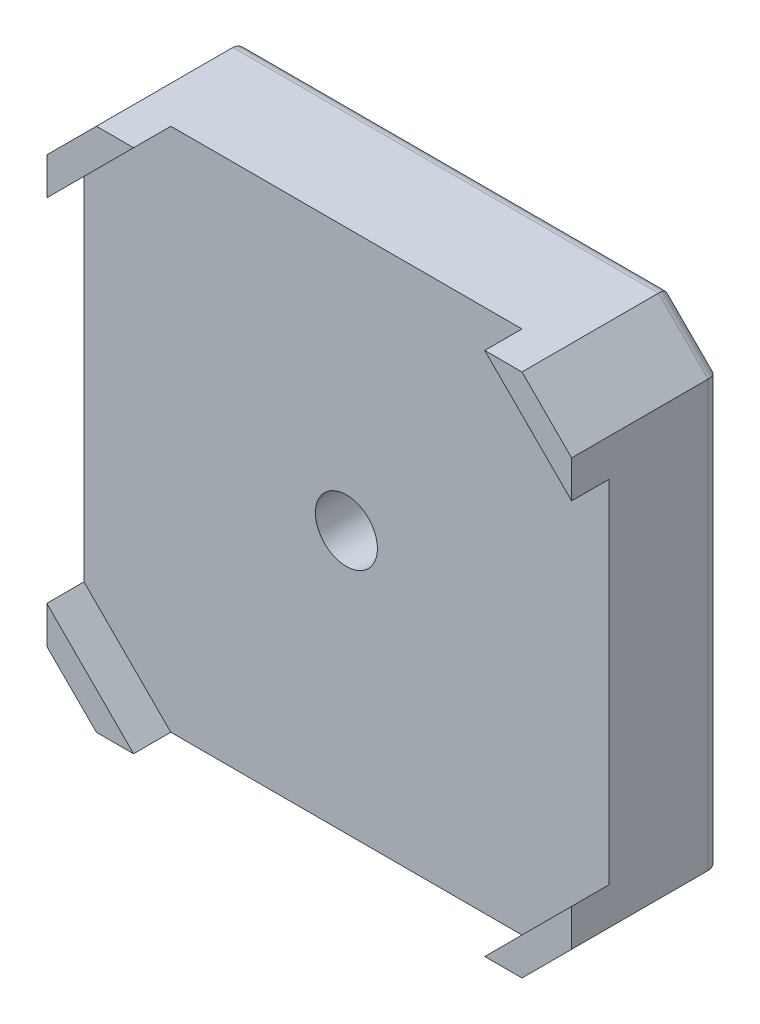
ISO-10303-21;
HEADER;
FILE_DESCRIPTION(('STEP AP214'),'2;1');
FILE_NAME('part.step','',(''),(''),'','','');
FILE_SCHEMA(('AUTOMOTIVE_DESIGN { 1 0 10303 214 1 1 1 1 }'));
ENDSEC;
DATA;
#1=APPLICATION_CONTEXT('core data for automotive mechanical design processes');
#2=APPLICATION_PROTOCOL_DEFINITION('international standard','automotive_design',2000,#1);
#3=PRODUCT_CONTEXT('',#1,'mechanical');
#4=PRODUCT('Part','Part','',(#3));
#5=PRODUCT_RELATED_PRODUCT_CATEGORY('part','',(#4));
#6=PRODUCT_DEFINITION_FORMATION('','',#4);
#7=PRODUCT_DEFINITION_CONTEXT('part definition',#1,'design');
#8=PRODUCT_DEFINITION('design','',#6,#7);
#9=PRODUCT_DEFINITION_SHAPE('','',#8);
#10=(LENGTH_UNIT() NAMED_UNIT(*) SI_UNIT(.MILLI.,.METRE.));
#11=(NAMED_UNIT(*) PLANE_ANGLE_UNIT() SI_UNIT($,.RADIAN.));
#12=(NAMED_UNIT(*) SI_UNIT($,.STERADIAN.) SOLID_ANGLE_UNIT());
#13=UNCERTAINTY_MEASURE_WITH_UNIT(LENGTH_MEASURE(1.E-05),#10,'distance_accuracy_value','');
#14=(GEOMETRIC_REPRESENTATION_CONTEXT(3) GLOBAL_UNCERTAINTY_ASSIGNED_CONTEXT((#13)) GLOBAL_UNIT_ASSIGNED_CONTEXT((#10,
#11,#12)) REPRESENTATION_CONTEXT('',''));
#15=CARTESIAN_POINT('',(0.,0.,0.));
#16=DIRECTION('',(0.,0.,1.));
#17=DIRECTION('',(1.,0.,0.));
#18=AXIS2_PLACEMENT_3D('',#15,#16,#17);
#19=CARTESIAN_POINT('',(0.,0.,12.));
#20=DIRECTION('',(0.,0.,-1.));
#21=DIRECTION('',(-1.,0.,0.));
#22=AXIS2_PLACEMENT_3D('',#19,#20,#21);
#23=PLANE('',#22);
#24=DIRECTION('',(-1.,0.,0.));
#25=VECTOR('',#24,1.);
#26=CARTESIAN_POINT('',(-17.15,21.15,12.));
#27=LINE('',#26,#25);
#28=CARTESIAN_POINT('',(17.15,21.15,12.));
#29=VERTEX_POINT('',#28);
#30=CARTESIAN_POINT('',(14.15,21.15,12.));
#31=VERTEX_POINT('',#30);
#32=EDGE_CURVE('E216',#29,#31,#27,.T.);
#33=ORIENTED_EDGE('',*,*,#32,.T.);
#34=DIRECTION('',(-0.707106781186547,0.707106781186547,0.));
#35=VECTOR('',#34,1.);
#36=CARTESIAN_POINT('',(14.15,21.15,12.));
#37=LINE('',#36,#35);
#38=CARTESIAN_POINT('',(21.15,14.15,12.));
#39=VERTEX_POINT('',#38);
#40=EDGE_CURVE('E201',#39,#31,#37,.T.);
#41=ORIENTED_EDGE('',*,*,#40,.F.);
#42=DIRECTION('',(0.,1.,0.));
#43=VECTOR('',#42,1.);
#44=CARTESIAN_POINT('',(21.15,17.15,12.));
#45=LINE('',#44,#43);
#46=CARTESIAN_POINT('',(21.15,17.15,12.));
#47=VERTEX_POINT('',#46);
#48=EDGE_CURVE('E239',#39,#47,#45,.T.);
#49=ORIENTED_EDGE('',*,*,#48,.T.);
#50=DIRECTION('',(-0.707106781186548,0.707106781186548,0.));
#51=VECTOR('',#50,1.);
#52=CARTESIAN_POINT('',(17.15,21.15,12.));
#53=LINE('',#52,#51);
#54=EDGE_CURVE('E244',#47,#29,#53,.T.);
#55=ORIENTED_EDGE('',*,*,#54,.T.);
#56=EDGE_LOOP('',(#33,#41,#49,#55));
#57=FACE_BOUND('',#56,.T.);
#58=ADVANCED_FACE('F39',(#57),#23,.F.);
#59=CARTESIAN_POINT('',(21.15,-17.15,12.));
#60=VERTEX_POINT('',#59);
#61=CARTESIAN_POINT('',(21.15,-14.15,12.));
#62=VERTEX_POINT('',#61);
#63=EDGE_CURVE('E240',#60,#62,#45,.T.);
#64=ORIENTED_EDGE('',*,*,#63,.T.);
#65=DIRECTION('',(0.707106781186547,0.707106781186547,0.));
#66=VECTOR('',#65,1.);
#67=CARTESIAN_POINT('',(21.15,-14.15,12.));
#68=LINE('',#67,#66);
#69=CARTESIAN_POINT('',(14.15,-21.15,12.));
#70=VERTEX_POINT('',#69);
#71=EDGE_CURVE('E497',#70,#62,#68,.T.);
#72=ORIENTED_EDGE('',*,*,#71,.F.);
#73=DIRECTION('',(1.,0.,0.));
#74=VECTOR('',#73,1.);
#75=CARTESIAN_POINT('',(-17.15,-21.15,12.));
#76=LINE('',#75,#74);
#77=CARTESIAN_POINT('',(17.15,-21.15,12.));
#78=VERTEX_POINT('',#77);
#79=EDGE_CURVE('E231',#70,#78,#76,.T.);
#80=ORIENTED_EDGE('',*,*,#79,.T.);
#81=DIRECTION('',(0.707106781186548,0.707106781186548,0.));
#82=VECTOR('',#81,1.);
#83=CARTESIAN_POINT('',(17.15,-21.15,12.));
#84=LINE('',#83,#82);
#85=EDGE_CURVE('E236',#78,#60,#84,.T.);
#86=ORIENTED_EDGE('',*,*,#85,.T.);
#87=EDGE_LOOP('',(#64,#72,#80,#86));
#88=FACE_BOUND('',#87,.T.);
#89=ADVANCED_FACE('F430',(#88),#23,.F.);
#90=CARTESIAN_POINT('',(-17.15,-21.15,12.));
#91=VERTEX_POINT('',#90);
#92=CARTESIAN_POINT('',(-14.15,-21.15,12.));
#93=VERTEX_POINT('',#92);
#94=EDGE_CURVE('E232',#91,#93,#76,.T.);
#95=ORIENTED_EDGE('',*,*,#94,.T.);
#96=DIRECTION('',(0.707106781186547,-0.707106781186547,0.));
#97=VECTOR('',#96,1.);
#98=CARTESIAN_POINT('',(-21.15,-14.15,12.));
#99=LINE('',#98,#97);
#100=CARTESIAN_POINT('',(-21.15,-14.15,12.));
#101=VERTEX_POINT('',#100);
#102=EDGE_CURVE('E463',#101,#93,#99,.T.);
#103=ORIENTED_EDGE('',*,*,#102,.F.);
#104=DIRECTION('',(0.,-1.,0.));
#105=VECTOR('',#104,1.);
#106=CARTESIAN_POINT('',(-21.15,17.15,12.));
#107=LINE('',#106,#105);
#108=CARTESIAN_POINT('',(-21.15,-17.15,12.));
#109=VERTEX_POINT('',#108);
#110=EDGE_CURVE('E223',#101,#109,#107,.T.);
#111=ORIENTED_EDGE('',*,*,#110,.T.);
#112=DIRECTION('',(0.707106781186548,-0.707106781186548,0.));
#113=VECTOR('',#112,1.);
#114=CARTESIAN_POINT('',(-21.15,-17.15,12.));
#115=LINE('',#114,#113);
#116=EDGE_CURVE('E228',#109,#91,#115,.T.);
#117=ORIENTED_EDGE('',*,*,#116,.T.);
#118=EDGE_LOOP('',(#95,#103,#111,#117));
#119=FACE_BOUND('',#118,.T.);
#120=ADVANCED_FACE('F437',(#119),#23,.F.);
#121=CARTESIAN_POINT('',(-17.15,21.15,12.));
#122=DIRECTION('',(0.,-1.,0.));
#123=DIRECTION('',(0.,0.,-1.));
#124=AXIS2_PLACEMENT_3D('',#121,#122,#123);
#125=PLANE('',#124);
#126=DIRECTION('',(0.,0.,-1.));
#127=VECTOR('',#126,1.);
#128=CARTESIAN_POINT('',(17.15,21.15,12.));
#129=LINE('',#128,#127);
#130=CARTESIAN_POINT('',(17.15,21.15,1.));
#131=VERTEX_POINT('',#130);
#132=EDGE_CURVE('E247',#29,#131,#129,.T.);
#133=ORIENTED_EDGE('',*,*,#132,.T.);
#134=DIRECTION('',(-1.,0.,0.));
#135=VECTOR('',#134,1.);
#136=CARTESIAN_POINT('',(-17.15,21.15,1.));
#137=LINE('',#136,#135);
#138=CARTESIAN_POINT('',(-17.15,21.15,1.));
#139=VERTEX_POINT('',#138);
#140=EDGE_CURVE('E55',#131,#139,#137,.T.);
#141=ORIENTED_EDGE('',*,*,#140,.T.);
#142=DIRECTION('',(0.,0.,-1.));
#143=VECTOR('',#142,1.);
#144=CARTESIAN_POINT('',(-17.15,21.15,12.));
#145=LINE('',#144,#143);
#146=CARTESIAN_POINT('',(-17.15,21.15,12.));
#147=VERTEX_POINT('',#146);
#148=EDGE_CURVE('E273',#147,#139,#145,.T.);
#149=ORIENTED_EDGE('',*,*,#148,.F.);
#150=CARTESIAN_POINT('',(-14.15,21.15,12.));
#151=VERTEX_POINT('',#150);
#152=EDGE_CURVE('E205',#151,#147,#27,.T.);
#153=ORIENTED_EDGE('',*,*,#152,.F.);
#154=DIRECTION('',(0.,0.,1.));
#155=VECTOR('',#154,1.);
#156=CARTESIAN_POINT('',(-14.15,21.15,9.));
#157=LINE('',#156,#155);
#158=CARTESIAN_POINT('',(-14.15,21.15,9.));
#159=VERTEX_POINT('',#158);
#160=EDGE_CURVE('E183',#159,#151,#157,.T.);
#161=ORIENTED_EDGE('',*,*,#160,.F.);
#162=DIRECTION('',(-1.,0.,0.));
#163=VECTOR('',#162,1.);
#164=CARTESIAN_POINT('',(-14.15,21.15,9.));
#165=LINE('',#164,#163);
#166=CARTESIAN_POINT('',(14.15,21.15,9.));
#167=VERTEX_POINT('',#166);
#168=EDGE_CURVE('E192',#167,#159,#165,.T.);
#169=ORIENTED_EDGE('',*,*,#168,.F.);
#170=DIRECTION('',(0.,0.,1.));
#171=VECTOR('',#170,1.);
#172=CARTESIAN_POINT('',(14.15,21.15,9.));
#173=LINE('',#172,#171);
#174=EDGE_CURVE('E492',#167,#31,#173,.T.);
#175=ORIENTED_EDGE('',*,*,#174,.T.);
#176=ORIENTED_EDGE('',*,*,#32,.F.);
#177=EDGE_LOOP('',(#133,#141,#149,#153,#161,#169,#175,#176));
#178=FACE_BOUND('',#177,.T.);
#179=ADVANCED_FACE('F204',(#178),#125,.F.);
#180=CARTESIAN_POINT('',(-21.15,17.15,12.));
#181=DIRECTION('',(0.707106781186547,-0.707106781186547,0.));
#182=DIRECTION('',(0.707106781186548,0.707106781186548,0.));
#183=AXIS2_PLACEMENT_3D('',#180,#181,#182);
#184=PLANE('',#183);
#185=ORIENTED_EDGE('',*,*,#148,.T.);
#186=DIRECTION('',(-0.707106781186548,-0.707106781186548,0.));
#187=VECTOR('',#186,1.);
#188=CARTESIAN_POINT('',(-21.15,17.15,1.));
#189=LINE('',#188,#187);
#190=CARTESIAN_POINT('',(-21.15,17.15,1.));
#191=VERTEX_POINT('',#190);
#192=EDGE_CURVE('E62',#139,#191,#189,.T.);
#193=ORIENTED_EDGE('',*,*,#192,.T.);
#194=DIRECTION('',(0.,0.,-1.));
#195=VECTOR('',#194,1.);
#196=CARTESIAN_POINT('',(-21.15,17.15,12.));
#197=LINE('',#196,#195);
#198=CARTESIAN_POINT('',(-21.15,17.15,12.));
#199=VERTEX_POINT('',#198);
#200=EDGE_CURVE('E270',#199,#191,#197,.T.);
#201=ORIENTED_EDGE('',*,*,#200,.F.);
#202=DIRECTION('',(-0.707106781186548,-0.707106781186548,0.));
#203=VECTOR('',#202,1.);
#204=CARTESIAN_POINT('',(-21.15,17.15,12.));
#205=LINE('',#204,#203);
#206=EDGE_CURVE('E220',#147,#199,#205,.T.);
#207=ORIENTED_EDGE('',*,*,#206,.F.);
#208=EDGE_LOOP('',(#185,#193,#201,#207));
#209=FACE_BOUND('',#208,.T.);
#210=ADVANCED_FACE('F459',(#209),#184,.F.);
#211=CARTESIAN_POINT('',(-21.15,17.15,12.));
#212=DIRECTION('',(1.,0.,0.));
#213=DIRECTION('',(0.,1.,0.));
#214=AXIS2_PLACEMENT_3D('',#211,#212,#213);
#215=PLANE('',#214);
#216=ORIENTED_EDGE('',*,*,#200,.T.);
#217=DIRECTION('',(0.,-1.,0.));
#218=VECTOR('',#217,1.);
#219=CARTESIAN_POINT('',(-21.15,-17.15,1.));
#220=LINE('',#219,#218);
#221=CARTESIAN_POINT('',(-21.15,-17.15,1.));
#222=VERTEX_POINT('',#221);
#223=EDGE_CURVE('E324',#191,#222,#220,.T.);
#224=ORIENTED_EDGE('',*,*,#223,.T.);
#225=DIRECTION('',(0.,0.,-1.));
#226=VECTOR('',#225,1.);
#227=CARTESIAN_POINT('',(-21.15,-17.15,12.));
#228=LINE('',#227,#226);
#229=EDGE_CURVE('E266',#109,#222,#228,.T.);
#230=ORIENTED_EDGE('',*,*,#229,.F.);
#231=ORIENTED_EDGE('',*,*,#110,.F.);
#232=DIRECTION('',(0.,0.,1.));
#233=VECTOR('',#232,1.);
#234=CARTESIAN_POINT('',(-21.15,-14.15,9.));
#235=LINE('',#234,#233);
#236=CARTESIAN_POINT('',(-21.15,-14.15,9.));
#237=VERTEX_POINT('',#236);
#238=EDGE_CURVE('E210',#237,#101,#235,.T.);
#239=ORIENTED_EDGE('',*,*,#238,.F.);
#240=DIRECTION('',(0.,-1.,0.));
#241=VECTOR('',#240,1.);
#242=CARTESIAN_POINT('',(-21.15,14.15,9.));
#243=LINE('',#242,#241);
#244=CARTESIAN_POINT('',(-21.15,14.15,9.));
#245=VERTEX_POINT('',#244);
#246=EDGE_CURVE('E191',#245,#237,#243,.T.);
#247=ORIENTED_EDGE('',*,*,#246,.F.);
#248=DIRECTION('',(0.,0.,1.));
#249=VECTOR('',#248,1.);
#250=CARTESIAN_POINT('',(-21.15,14.15,9.));
#251=LINE('',#250,#249);
#252=CARTESIAN_POINT('',(-21.15,14.15,12.));
#253=VERTEX_POINT('',#252);
#254=EDGE_CURVE('E186',#245,#253,#251,.T.);
#255=ORIENTED_EDGE('',*,*,#254,.T.);
#256=EDGE_CURVE('E224',#199,#253,#107,.T.);
#257=ORIENTED_EDGE('',*,*,#256,.F.);
#258=EDGE_LOOP('',(#216,#224,#230,#231,#239,#247,#255,#257));
#259=FACE_BOUND('',#258,.T.);
#260=ADVANCED_FACE('F870',(#259),#215,.F.);
#261=CARTESIAN_POINT('',(-21.15,-17.15,12.));
#262=DIRECTION('',(0.707106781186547,0.707106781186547,0.));
#263=DIRECTION('',(-0.707106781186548,0.707106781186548,0.));
#264=AXIS2_PLACEMENT_3D('',#261,#262,#263);
#265=PLANE('',#264);
#266=ORIENTED_EDGE('',*,*,#229,.T.);
#267=DIRECTION('',(0.707106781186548,-0.707106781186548,0.));
#268=VECTOR('',#267,1.);
#269=CARTESIAN_POINT('',(-17.15,-21.15,1.));
#270=LINE('',#269,#268);
#271=CARTESIAN_POINT('',(-17.15,-21.15,1.));
#272=VERTEX_POINT('',#271);
#273=EDGE_CURVE('E321',#222,#272,#270,.T.);
#274=ORIENTED_EDGE('',*,*,#273,.T.);
#275=DIRECTION('',(0.,0.,-1.));
#276=VECTOR('',#275,1.);
#277=CARTESIAN_POINT('',(-17.15,-21.15,12.));
#278=LINE('',#277,#276);
#279=EDGE_CURVE('E262',#91,#272,#278,.T.);
#280=ORIENTED_EDGE('',*,*,#279,.F.);
#281=ORIENTED_EDGE('',*,*,#116,.F.);
#282=EDGE_LOOP('',(#266,#274,#280,#281));
#283=FACE_BOUND('',#282,.T.);
#284=ADVANCED_FACE('F862',(#283),#265,.F.);
#285=CARTESIAN_POINT('',(-17.15,-21.15,12.));
#286=DIRECTION('',(0.,1.,0.));
#287=DIRECTION('',(-1.,0.,0.));
#288=AXIS2_PLACEMENT_3D('',#285,#286,#287);
#289=PLANE('',#288);
#290=ORIENTED_EDGE('',*,*,#279,.T.);
#291=DIRECTION('',(1.,0.,0.));
#292=VECTOR('',#291,1.);
#293=CARTESIAN_POINT('',(17.15,-21.15,1.));
#294=LINE('',#293,#292);
#295=CARTESIAN_POINT('',(17.15,-21.15,1.));
#296=VERTEX_POINT('',#295);
#297=EDGE_CURVE('E318',#272,#296,#294,.T.);
#298=ORIENTED_EDGE('',*,*,#297,.T.);
#299=DIRECTION('',(0.,0.,-1.));
#300=VECTOR('',#299,1.);
#301=CARTESIAN_POINT('',(17.15,-21.15,12.));
#302=LINE('',#301,#300);
#303=EDGE_CURVE('E258',#78,#296,#302,.T.);
#304=ORIENTED_EDGE('',*,*,#303,.F.);
#305=ORIENTED_EDGE('',*,*,#79,.F.);
#306=DIRECTION('',(0.,0.,1.));
#307=VECTOR('',#306,1.);
#308=CARTESIAN_POINT('',(14.15,-21.15,9.));
#309=LINE('',#308,#307);
#310=CARTESIAN_POINT('',(14.15,-21.15,9.));
#311=VERTEX_POINT('',#310);
#312=EDGE_CURVE('E479',#311,#70,#309,.T.);
#313=ORIENTED_EDGE('',*,*,#312,.F.);
#314=DIRECTION('',(1.,0.,0.));
#315=VECTOR('',#314,1.);
#316=CARTESIAN_POINT('',(-14.15,-21.15,9.));
#317=LINE('',#316,#315);
#318=CARTESIAN_POINT('',(-14.15,-21.15,9.));
#319=VERTEX_POINT('',#318);
#320=EDGE_CURVE('E475',#319,#311,#317,.T.);
#321=ORIENTED_EDGE('',*,*,#320,.F.);
#322=DIRECTION('',(0.,0.,1.));
#323=VECTOR('',#322,1.);
#324=CARTESIAN_POINT('',(-14.15,-21.15,9.));
#325=LINE('',#324,#323);
#326=EDGE_CURVE('E472',#319,#93,#325,.T.);
#327=ORIENTED_EDGE('',*,*,#326,.T.);
#328=ORIENTED_EDGE('',*,*,#94,.F.);
#329=EDGE_LOOP('',(#290,#298,#304,#305,#313,#321,#327,#328));
#330=FACE_BOUND('',#329,.T.);
#331=ADVANCED_FACE('F469',(#330),#289,.F.);
#332=CARTESIAN_POINT('',(17.15,-21.15,12.));
#333=DIRECTION('',(-0.707106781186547,0.707106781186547,0.));
#334=DIRECTION('',(-0.707106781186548,-0.707106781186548,0.));
#335=AXIS2_PLACEMENT_3D('',#332,#333,#334);
#336=PLANE('',#335);
#337=ORIENTED_EDGE('',*,*,#303,.T.);
#338=DIRECTION('',(0.707106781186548,0.707106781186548,0.));
#339=VECTOR('',#338,1.);
#340=CARTESIAN_POINT('',(21.15,-17.15,1.));
#341=LINE('',#340,#339);
#342=CARTESIAN_POINT('',(21.15,-17.15,1.));
#343=VERTEX_POINT('',#342);
#344=EDGE_CURVE('E315',#296,#343,#341,.T.);
#345=ORIENTED_EDGE('',*,*,#344,.T.);
#346=DIRECTION('',(0.,0.,-1.));
#347=VECTOR('',#346,1.);
#348=CARTESIAN_POINT('',(21.15,-17.15,12.));
#349=LINE('',#348,#347);
#350=EDGE_CURVE('E254',#60,#343,#349,.T.);
#351=ORIENTED_EDGE('',*,*,#350,.F.);
#352=ORIENTED_EDGE('',*,*,#85,.F.);
#353=EDGE_LOOP('',(#337,#345,#351,#352));
#354=FACE_BOUND('',#353,.T.);
#355=ADVANCED_FACE('F845',(#354),#336,.F.);
#356=CARTESIAN_POINT('',(21.15,17.15,12.));
#357=DIRECTION('',(-1.,0.,0.));
#358=DIRECTION('',(0.,-1.,0.));
#359=AXIS2_PLACEMENT_3D('',#356,#357,#358);
#360=PLANE('',#359);
#361=ORIENTED_EDGE('',*,*,#350,.T.);
#362=DIRECTION('',(0.,1.,0.));
#363=VECTOR('',#362,1.);
#364=CARTESIAN_POINT('',(21.15,17.15,1.));
#365=LINE('',#364,#363);
#366=CARTESIAN_POINT('',(21.15,17.15,1.));
#367=VERTEX_POINT('',#366);
#368=EDGE_CURVE('E312',#343,#367,#365,.T.);
#369=ORIENTED_EDGE('',*,*,#368,.T.);
#370=DIRECTION('',(0.,0.,-1.));
#371=VECTOR('',#370,1.);
#372=CARTESIAN_POINT('',(21.15,17.15,12.));
#373=LINE('',#372,#371);
#374=EDGE_CURVE('E250',#47,#367,#373,.T.);
#375=ORIENTED_EDGE('',*,*,#374,.F.);
#376=ORIENTED_EDGE('',*,*,#48,.F.);
#377=DIRECTION('',(0.,0.,1.));
#378=VECTOR('',#377,1.);
#379=CARTESIAN_POINT('',(21.15,14.15,9.));
#380=LINE('',#379,#378);
#381=CARTESIAN_POINT('',(21.15,14.15,9.));
#382=VERTEX_POINT('',#381);
#383=EDGE_CURVE('E489',#382,#39,#380,.T.);
#384=ORIENTED_EDGE('',*,*,#383,.F.);
#385=DIRECTION('',(0.,1.,0.));
#386=VECTOR('',#385,1.);
#387=CARTESIAN_POINT('',(21.15,14.15,9.));
#388=LINE('',#387,#386);
#389=CARTESIAN_POINT('',(21.15,-14.15,9.));
#390=VERTEX_POINT('',#389);
#391=EDGE_CURVE('E212',#390,#382,#388,.T.);
#392=ORIENTED_EDGE('',*,*,#391,.F.);
#393=DIRECTION('',(0.,0.,1.));
#394=VECTOR('',#393,1.);
#395=CARTESIAN_POINT('',(21.15,-14.15,9.));
#396=LINE('',#395,#394);
#397=EDGE_CURVE('E483',#390,#62,#396,.T.);
#398=ORIENTED_EDGE('',*,*,#397,.T.);
#399=ORIENTED_EDGE('',*,*,#63,.F.);
#400=EDGE_LOOP('',(#361,#369,#375,#376,#384,#392,#398,#399));
#401=FACE_BOUND('',#400,.T.);
#402=ADVANCED_FACE('F451',(#401),#360,.F.);
#403=CARTESIAN_POINT('',(17.15,21.15,12.));
#404=DIRECTION('',(-0.707106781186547,-0.707106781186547,0.));
#405=DIRECTION('',(0.707106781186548,-0.707106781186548,0.));
#406=AXIS2_PLACEMENT_3D('',#403,#404,#405);
#407=PLANE('',#406);
#408=ORIENTED_EDGE('',*,*,#374,.T.);
#409=DIRECTION('',(-0.707106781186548,0.707106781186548,0.));
#410=VECTOR('',#409,1.);
#411=CARTESIAN_POINT('',(17.15,21.15,1.));
#412=LINE('',#411,#410);
#413=EDGE_CURVE('E283',#367,#131,#412,.T.);
#414=ORIENTED_EDGE('',*,*,#413,.T.);
#415=ORIENTED_EDGE('',*,*,#132,.F.);
#416=ORIENTED_EDGE('',*,*,#54,.F.);
#417=EDGE_LOOP('',(#408,#414,#415,#416));
#418=FACE_BOUND('',#417,.T.);
#419=ADVANCED_FACE('F443',(#418),#407,.F.);
#420=ORIENTED_EDGE('',*,*,#256,.T.);
#421=DIRECTION('',(-0.707106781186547,-0.707106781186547,0.));
#422=VECTOR('',#421,1.);
#423=CARTESIAN_POINT('',(-21.15,14.15,12.));
#424=LINE('',#423,#422);
#425=EDGE_CURVE('E281',#151,#253,#424,.T.);
#426=ORIENTED_EDGE('',*,*,#425,.F.);
#427=ORIENTED_EDGE('',*,*,#152,.T.);
#428=ORIENTED_EDGE('',*,*,#206,.T.);
#429=EDGE_LOOP('',(#420,#426,#427,#428));
#430=FACE_BOUND('',#429,.T.);
#431=ADVANCED_FACE('F433',(#430),#23,.F.);
#432=CARTESIAN_POINT('',(0.,0.,0.));
#433=DIRECTION('',(0.,0.,-1.));
#434=DIRECTION('',(-1.,0.,0.));
#435=AXIS2_PLACEMENT_3D('',#432,#433,#434);
#436=PLANE('',#435);
#437=CARTESIAN_POINT('',(15.5,15.5,0.));
#438=DIRECTION('',(0.,0.,-1.));
#439=DIRECTION('',(-1.,0.,0.));
#440=AXIS2_PLACEMENT_3D('',#437,#438,#439);
#441=CIRCLE('',#440,2.);
#442=CARTESIAN_POINT('',(13.5,15.5,0.));
#443=VERTEX_POINT('',#442);
#444=EDGE_CURVE('E402',#443,#443,#441,.F.);
#445=ORIENTED_EDGE('',*,*,#444,.T.);
#446=EDGE_LOOP('',(#445));
#447=FACE_BOUND('',#446,.T.);
#448=CARTESIAN_POINT('',(15.5,-15.5,0.));
#449=DIRECTION('',(0.,0.,-1.));
#450=DIRECTION('',(-1.,0.,0.));
#451=AXIS2_PLACEMENT_3D('',#448,#449,#450);
#452=CIRCLE('',#451,2.);
#453=CARTESIAN_POINT('',(13.5,-15.5,0.));
#454=VERTEX_POINT('',#453);
#455=EDGE_CURVE('E398',#454,#454,#452,.F.);
#456=ORIENTED_EDGE('',*,*,#455,.T.);
#457=EDGE_LOOP('',(#456));
#458=FACE_BOUND('',#457,.T.);
#459=CARTESIAN_POINT('',(-15.5,-15.5,0.));
#460=DIRECTION('',(0.,0.,-1.));
#461=DIRECTION('',(-1.,0.,0.));
#462=AXIS2_PLACEMENT_3D('',#459,#460,#461);
#463=CIRCLE('',#462,2.);
#464=CARTESIAN_POINT('',(-17.5,-15.5,0.));
#465=VERTEX_POINT('',#464);
#466=EDGE_CURVE('E394',#465,#465,#463,.F.);
#467=ORIENTED_EDGE('',*,*,#466,.T.);
#468=EDGE_LOOP('',(#467));
#469=FACE_BOUND('',#468,.T.);
#470=CARTESIAN_POINT('',(-15.5,15.5,0.));
#471=DIRECTION('',(0.,0.,-1.));
#472=DIRECTION('',(-1.,0.,0.));
#473=AXIS2_PLACEMENT_3D('',#470,#471,#472);
#474=CIRCLE('',#473,2.);
#475=CARTESIAN_POINT('',(-17.5,15.5,0.));
#476=VERTEX_POINT('',#475);
#477=EDGE_CURVE('E390',#476,#476,#474,.F.);
#478=ORIENTED_EDGE('',*,*,#477,.T.);
#479=EDGE_LOOP('',(#478));
#480=FACE_BOUND('',#479,.T.);
#481=DIRECTION('',(-1.,0.,0.));
#482=VECTOR('',#481,1.);
#483=CARTESIAN_POINT('',(17.15,20.15,0.));
#484=LINE('',#483,#482);
#485=CARTESIAN_POINT('',(-16.7357864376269,20.15,0.));
#486=VERTEX_POINT('',#485);
#487=CARTESIAN_POINT('',(16.7357864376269,20.15,0.));
#488=VERTEX_POINT('',#487);
#489=EDGE_CURVE('E287',#486,#488,#484,.F.);
#490=ORIENTED_EDGE('',*,*,#489,.T.);
#491=DIRECTION('',(-0.707106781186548,0.707106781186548,0.));
#492=VECTOR('',#491,1.);
#493=CARTESIAN_POINT('',(20.4428932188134,16.4428932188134,0.));
#494=LINE('',#493,#492);
#495=CARTESIAN_POINT('',(20.15,16.7357864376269,0.));
#496=VERTEX_POINT('',#495);
#497=EDGE_CURVE('E308',#488,#496,#494,.F.);
#498=ORIENTED_EDGE('',*,*,#497,.T.);
#499=DIRECTION('',(0.,1.,0.));
#500=VECTOR('',#499,1.);
#501=CARTESIAN_POINT('',(20.15,-17.15,0.));
#502=LINE('',#501,#500);
#503=CARTESIAN_POINT('',(20.15,-16.7357864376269,0.));
#504=VERTEX_POINT('',#503);
#505=EDGE_CURVE('E305',#496,#504,#502,.F.);
#506=ORIENTED_EDGE('',*,*,#505,.T.);
#507=DIRECTION('',(0.707106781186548,0.707106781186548,0.));
#508=VECTOR('',#507,1.);
#509=CARTESIAN_POINT('',(16.4428932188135,-20.4428932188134,0.));
#510=LINE('',#509,#508);
#511=CARTESIAN_POINT('',(16.7357864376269,-20.15,0.));
#512=VERTEX_POINT('',#511);
#513=EDGE_CURVE('E302',#504,#512,#510,.F.);
#514=ORIENTED_EDGE('',*,*,#513,.T.);
#515=DIRECTION('',(1.,0.,0.));
#516=VECTOR('',#515,1.);
#517=CARTESIAN_POINT('',(-17.15,-20.15,0.));
#518=LINE('',#517,#516);
#519=CARTESIAN_POINT('',(-16.7357864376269,-20.15,0.));
#520=VERTEX_POINT('',#519);
#521=EDGE_CURVE('E299',#512,#520,#518,.F.);
#522=ORIENTED_EDGE('',*,*,#521,.T.);
#523=DIRECTION('',(0.707106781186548,-0.707106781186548,0.));
#524=VECTOR('',#523,1.);
#525=CARTESIAN_POINT('',(-20.4428932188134,-16.4428932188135,0.));
#526=LINE('',#525,#524);
#527=CARTESIAN_POINT('',(-20.15,-16.7357864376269,0.));
#528=VERTEX_POINT('',#527);
#529=EDGE_CURVE('E296',#520,#528,#526,.F.);
#530=ORIENTED_EDGE('',*,*,#529,.T.);
#531=DIRECTION('',(0.,-1.,0.));
#532=VECTOR('',#531,1.);
#533=CARTESIAN_POINT('',(-20.15,17.15,0.));
#534=LINE('',#533,#532);
#535=CARTESIAN_POINT('',(-20.15,16.7357864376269,0.));
#536=VERTEX_POINT('',#535);
#537=EDGE_CURVE('E293',#528,#536,#534,.F.);
#538=ORIENTED_EDGE('',*,*,#537,.T.);
#539=DIRECTION('',(-0.707106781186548,-0.707106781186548,0.));
#540=VECTOR('',#539,1.);
#541=CARTESIAN_POINT('',(-16.4428932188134,20.4428932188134,0.));
#542=LINE('',#541,#540);
#543=EDGE_CURVE('E290',#536,#486,#542,.F.);
#544=ORIENTED_EDGE('',*,*,#543,.T.);
#545=EDGE_LOOP('',(#490,#498,#506,#514,#522,#530,#538,#544));
#546=FACE_BOUND('',#545,.T.);
#547=CARTESIAN_POINT('',(0.,0.,0.));
#548=DIRECTION('',(0.,0.,-1.));
#549=DIRECTION('',(-1.,0.,0.));
#550=AXIS2_PLACEMENT_3D('',#547,#548,#549);
#551=CIRCLE('',#550,11.);
#552=CARTESIAN_POINT('',(-11.,0.,0.));
#553=VERTEX_POINT('',#552);
#554=EDGE_CURVE('E276',#553,#553,#551,.T.);
#555=ORIENTED_EDGE('',*,*,#554,.F.);
#556=EDGE_LOOP('',(#555));
#557=FACE_BOUND('',#556,.T.);
#558=ADVANCED_FACE('F442',(#447,#458,#469,#480,#546,#557),#436,.T.);
#559=CARTESIAN_POINT('',(14.15,21.15,9.));
#560=DIRECTION('',(0.707106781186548,0.707106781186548,0.));
#561=DIRECTION('',(-0.707106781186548,0.707106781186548,0.));
#562=AXIS2_PLACEMENT_3D('',#559,#560,#561);
#563=PLANE('',#562);
#564=ORIENTED_EDGE('',*,*,#40,.T.);
#565=ORIENTED_EDGE('',*,*,#174,.F.);
#566=DIRECTION('',(-0.707106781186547,0.707106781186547,0.));
#567=VECTOR('',#566,1.);
#568=CARTESIAN_POINT('',(14.15,21.15,9.));
#569=LINE('',#568,#567);
#570=EDGE_CURVE('E198',#382,#167,#569,.T.);
#571=ORIENTED_EDGE('',*,*,#570,.F.);
#572=ORIENTED_EDGE('',*,*,#383,.T.);
#573=EDGE_LOOP('',(#564,#565,#571,#572));
#574=FACE_BOUND('',#573,.T.);
#575=ADVANCED_FACE('F449',(#574),#563,.F.);
#576=CARTESIAN_POINT('',(21.15,-14.15,9.));
#577=DIRECTION('',(0.707106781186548,-0.707106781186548,0.));
#578=DIRECTION('',(0.707106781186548,0.707106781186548,0.));
#579=AXIS2_PLACEMENT_3D('',#576,#577,#578);
#580=PLANE('',#579);
#581=ORIENTED_EDGE('',*,*,#71,.T.);
#582=ORIENTED_EDGE('',*,*,#397,.F.);
#583=DIRECTION('',(0.707106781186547,0.707106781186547,0.));
#584=VECTOR('',#583,1.);
#585=CARTESIAN_POINT('',(21.15,-14.15,9.));
#586=LINE('',#585,#584);
#587=EDGE_CURVE('E506',#311,#390,#586,.T.);
#588=ORIENTED_EDGE('',*,*,#587,.F.);
#589=ORIENTED_EDGE('',*,*,#312,.T.);
#590=EDGE_LOOP('',(#581,#582,#588,#589));
#591=FACE_BOUND('',#590,.T.);
#592=ADVANCED_FACE('F599',(#591),#580,.F.);
#593=CARTESIAN_POINT('',(-21.15,-14.15,9.));
#594=DIRECTION('',(-0.707106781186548,-0.707106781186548,0.));
#595=DIRECTION('',(0.707106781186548,-0.707106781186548,0.));
#596=AXIS2_PLACEMENT_3D('',#593,#594,#595);
#597=PLANE('',#596);
#598=ORIENTED_EDGE('',*,*,#102,.T.);
#599=ORIENTED_EDGE('',*,*,#326,.F.);
#600=DIRECTION('',(0.707106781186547,-0.707106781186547,0.));
#601=VECTOR('',#600,1.);
#602=CARTESIAN_POINT('',(-21.15,-14.15,9.));
#603=LINE('',#602,#601);
#604=EDGE_CURVE('E512',#237,#319,#603,.T.);
#605=ORIENTED_EDGE('',*,*,#604,.F.);
#606=ORIENTED_EDGE('',*,*,#238,.T.);
#607=EDGE_LOOP('',(#598,#599,#605,#606));
#608=FACE_BOUND('',#607,.T.);
#609=ADVANCED_FACE('F603',(#608),#597,.F.);
#610=CARTESIAN_POINT('',(-21.15,14.15,9.));
#611=DIRECTION('',(-0.707106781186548,0.707106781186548,0.));
#612=DIRECTION('',(-0.707106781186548,-0.707106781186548,0.));
#613=AXIS2_PLACEMENT_3D('',#610,#611,#612);
#614=PLANE('',#613);
#615=ORIENTED_EDGE('',*,*,#425,.T.);
#616=ORIENTED_EDGE('',*,*,#254,.F.);
#617=DIRECTION('',(-0.707106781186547,-0.707106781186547,0.));
#618=VECTOR('',#617,1.);
#619=CARTESIAN_POINT('',(-21.15,14.15,9.));
#620=LINE('',#619,#618);
#621=EDGE_CURVE('E179',#159,#245,#620,.T.);
#622=ORIENTED_EDGE('',*,*,#621,.F.);
#623=ORIENTED_EDGE('',*,*,#160,.T.);
#624=EDGE_LOOP('',(#615,#616,#622,#623));
#625=FACE_BOUND('',#624,.T.);
#626=ADVANCED_FACE('F181',(#625),#614,.F.);
#627=CARTESIAN_POINT('',(0.,0.,9.));
#628=DIRECTION('',(0.,0.,-1.));
#629=DIRECTION('',(-1.,0.,0.));
#630=AXIS2_PLACEMENT_3D('',#627,#628,#629);
#631=PLANE('',#630);
#632=CARTESIAN_POINT('',(0.,0.,9.));
#633=DIRECTION('',(0.,0.,-1.));
#634=DIRECTION('',(-1.,0.,0.));
#635=AXIS2_PLACEMENT_3D('',#632,#633,#634);
#636=CIRCLE('',#635,2.5);
#637=CARTESIAN_POINT('',(-2.5,0.,9.));
#638=VERTEX_POINT('',#637);
#639=EDGE_CURVE('E277',#638,#638,#636,.T.);
#640=ORIENTED_EDGE('',*,*,#639,.T.);
#641=EDGE_LOOP('',(#640));
#642=FACE_BOUND('',#641,.T.);
#643=ORIENTED_EDGE('',*,*,#168,.T.);
#644=ORIENTED_EDGE('',*,*,#621,.T.);
#645=ORIENTED_EDGE('',*,*,#246,.T.);
#646=ORIENTED_EDGE('',*,*,#604,.T.);
#647=ORIENTED_EDGE('',*,*,#320,.T.);
#648=ORIENTED_EDGE('',*,*,#587,.T.);
#649=ORIENTED_EDGE('',*,*,#391,.T.);
#650=ORIENTED_EDGE('',*,*,#570,.T.);
#651=EDGE_LOOP('',(#643,#644,#645,#646,#647,#648,#649,#650));
#652=FACE_BOUND('',#651,.T.);
#653=ADVANCED_FACE('F196',(#642,#652),#631,.F.);
#654=CARTESIAN_POINT('',(0.,0.,-2.));
#655=DIRECTION('',(0.,0.,1.));
#656=DIRECTION('',(1.,0.,0.));
#657=AXIS2_PLACEMENT_3D('',#654,#655,#656);
#658=CYLINDRICAL_SURFACE('',#657,11.);
#659=CARTESIAN_POINT('',(0.,0.,-1.5));
#660=DIRECTION('',(0.,0.,-1.));
#661=DIRECTION('',(-1.,0.,0.));
#662=AXIS2_PLACEMENT_3D('',#659,#660,#661);
#663=CIRCLE('',#662,11.);
#664=CARTESIAN_POINT('',(-11.,0.,-1.5));
#665=VERTEX_POINT('',#664);
#666=EDGE_CURVE('E382',#665,#665,#663,.F.);
#667=ORIENTED_EDGE('',*,*,#666,.T.);
#668=EDGE_LOOP('',(#667));
#669=FACE_BOUND('',#668,.T.);
#670=ORIENTED_EDGE('',*,*,#554,.T.);
#671=EDGE_LOOP('',(#670));
#672=FACE_BOUND('',#671,.T.);
#673=ADVANCED_FACE('F589',(#669,#672),#658,.T.);
#674=CARTESIAN_POINT('',(0.,0.,-2.));
#675=DIRECTION('',(0.,0.,-1.));
#676=DIRECTION('',(-1.,0.,0.));
#677=AXIS2_PLACEMENT_3D('',#674,#675,#676);
#678=PLANE('',#677);
#679=CARTESIAN_POINT('',(0.,0.,-2.));
#680=DIRECTION('',(0.,0.,-1.));
#681=DIRECTION('',(-1.,0.,0.));
#682=AXIS2_PLACEMENT_3D('',#679,#680,#681);
#683=CIRCLE('',#682,6.);
#684=CARTESIAN_POINT('',(-6.,0.,-2.));
#685=VERTEX_POINT('',#684);
#686=EDGE_CURVE('E374',#685,#685,#683,.F.);
#687=ORIENTED_EDGE('',*,*,#686,.T.);
#688=EDGE_LOOP('',(#687));
#689=FACE_BOUND('',#688,.T.);
#690=CARTESIAN_POINT('',(0.,0.,-2.));
#691=DIRECTION('',(0.,0.,-1.));
#692=DIRECTION('',(-1.,0.,0.));
#693=AXIS2_PLACEMENT_3D('',#690,#691,#692);
#694=CIRCLE('',#693,10.5);
#695=CARTESIAN_POINT('',(-10.5,0.,-2.));
#696=VERTEX_POINT('',#695);
#697=EDGE_CURVE('E370',#696,#696,#694,.T.);
#698=ORIENTED_EDGE('',*,*,#697,.T.);
#699=EDGE_LOOP('',(#698));
#700=FACE_BOUND('',#699,.T.);
#701=ADVANCED_FACE('F585',(#689,#700),#678,.T.);
#702=CARTESIAN_POINT('',(0.,0.,5.));
#703=DIRECTION('',(0.,0.,-1.));
#704=DIRECTION('',(-1.,0.,0.));
#705=AXIS2_PLACEMENT_3D('',#702,#703,#704);
#706=CYLINDRICAL_SURFACE('',#705,5.5);
#707=CARTESIAN_POINT('',(0.,0.,-1.5));
#708=DIRECTION('',(0.,0.,-1.));
#709=DIRECTION('',(-1.,0.,0.));
#710=AXIS2_PLACEMENT_3D('',#707,#708,#709);
#711=CIRCLE('',#710,5.5);
#712=CARTESIAN_POINT('',(-5.5,0.,-1.5));
#713=VERTEX_POINT('',#712);
#714=EDGE_CURVE('E366',#713,#713,#711,.T.);
#715=ORIENTED_EDGE('',*,*,#714,.T.);
#716=EDGE_LOOP('',(#715));
#717=FACE_BOUND('',#716,.T.);
#718=CARTESIAN_POINT('',(0.,0.,4.5));
#719=DIRECTION('',(0.,0.,-1.));
#720=DIRECTION('',(-1.,0.,0.));
#721=AXIS2_PLACEMENT_3D('',#718,#719,#720);
#722=CIRCLE('',#721,5.5);
#723=CARTESIAN_POINT('',(-5.5,0.,4.5));
#724=VERTEX_POINT('',#723);
#725=EDGE_CURVE('E331',#724,#724,#722,.F.);
#726=ORIENTED_EDGE('',*,*,#725,.T.);
#727=EDGE_LOOP('',(#726));
#728=FACE_BOUND('',#727,.T.);
#729=ADVANCED_FACE('F581',(#717,#728),#706,.F.);
#730=CARTESIAN_POINT('',(0.,0.,5.));
#731=DIRECTION('',(0.,0.,-1.));
#732=DIRECTION('',(-1.,0.,0.));
#733=AXIS2_PLACEMENT_3D('',#730,#731,#732);
#734=PLANE('',#733);
#735=CARTESIAN_POINT('',(0.,0.,5.));
#736=DIRECTION('',(0.,0.,-1.));
#737=DIRECTION('',(-1.,0.,0.));
#738=AXIS2_PLACEMENT_3D('',#735,#736,#737);
#739=CIRCLE('',#738,5.);
#740=CARTESIAN_POINT('',(-5.,0.,5.));
#741=VERTEX_POINT('',#740);
#742=EDGE_CURVE('E378',#741,#741,#739,.T.);
#743=ORIENTED_EDGE('',*,*,#742,.T.);
#744=EDGE_LOOP('',(#743));
#745=FACE_BOUND('',#744,.T.);
#746=CARTESIAN_POINT('',(0.,0.,5.));
#747=DIRECTION('',(0.,0.,-1.));
#748=DIRECTION('',(-1.,0.,0.));
#749=AXIS2_PLACEMENT_3D('',#746,#747,#748);
#750=CIRCLE('',#749,2.5);
#751=CARTESIAN_POINT('',(-2.5,0.,5.));
#752=VERTEX_POINT('',#751);
#753=EDGE_CURVE('E282',#752,#752,#750,.T.);
#754=ORIENTED_EDGE('',*,*,#753,.F.);
#755=EDGE_LOOP('',(#754));
#756=FACE_BOUND('',#755,.T.);
#757=ADVANCED_FACE('F577',(#745,#756),#734,.T.);
#758=CARTESIAN_POINT('',(0.,0.,12.));
#759=DIRECTION('',(0.,0.,-1.));
#760=DIRECTION('',(-1.,0.,0.));
#761=AXIS2_PLACEMENT_3D('',#758,#759,#760);
#762=CYLINDRICAL_SURFACE('',#761,2.5);
#763=ORIENTED_EDGE('',*,*,#753,.T.);
#764=EDGE_LOOP('',(#763));
#765=FACE_BOUND('',#764,.T.);
#766=ORIENTED_EDGE('',*,*,#639,.F.);
#767=EDGE_LOOP('',(#766));
#768=FACE_BOUND('',#767,.T.);
#769=ADVANCED_FACE('F573',(#765,#768),#762,.F.);
#770=CARTESIAN_POINT('',(-20.4428932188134,-16.4428932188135,1.));
#771=DIRECTION('',(-0.707106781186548,0.707106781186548,0.));
#772=DIRECTION('',(-0.707106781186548,-0.707106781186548,0.));
#773=AXIS2_PLACEMENT_3D('',#770,#771,#772);
#774=CYLINDRICAL_SURFACE('',#773,1.);
#775=CARTESIAN_POINT('',(-20.15,-16.7357864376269,1.));
#776=DIRECTION('',(-0.38268343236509,0.923879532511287,0.));
#777=DIRECTION('',(0.923879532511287,0.38268343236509,0.));
#778=AXIS2_PLACEMENT_3D('',#775,#776,#777);
#779=ELLIPSE('',#778,1.08239220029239,1.);
#780=EDGE_CURVE('E355',#528,#222,#779,.T.);
#781=ORIENTED_EDGE('',*,*,#780,.F.);
#782=ORIENTED_EDGE('',*,*,#529,.F.);
#783=CARTESIAN_POINT('',(-16.7357864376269,-20.15,1.));
#784=DIRECTION('',(-0.923879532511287,0.38268343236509,0.));
#785=DIRECTION('',(0.38268343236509,0.923879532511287,0.));
#786=AXIS2_PLACEMENT_3D('',#783,#784,#785);
#787=ELLIPSE('',#786,1.08239220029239,1.);
#788=EDGE_CURVE('E359',#272,#520,#787,.F.);
#789=ORIENTED_EDGE('',*,*,#788,.F.);
#790=ORIENTED_EDGE('',*,*,#273,.F.);
#791=EDGE_LOOP('',(#781,#782,#789,#790));
#792=FACE_BOUND('',#791,.T.);
#793=ADVANCED_FACE('F576',(#792),#774,.T.);
#794=CARTESIAN_POINT('',(-17.15,-20.15,1.));
#795=DIRECTION('',(-1.,0.,0.));
#796=DIRECTION('',(0.,-1.,0.));
#797=AXIS2_PLACEMENT_3D('',#794,#795,#796);
#798=CYLINDRICAL_SURFACE('',#797,1.);
#799=ORIENTED_EDGE('',*,*,#788,.T.);
#800=ORIENTED_EDGE('',*,*,#521,.F.);
#801=CARTESIAN_POINT('',(16.7357864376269,-20.15,1.));
#802=DIRECTION('',(-0.923879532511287,-0.38268343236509,0.));
#803=DIRECTION('',(-0.38268343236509,0.923879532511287,0.));
#804=AXIS2_PLACEMENT_3D('',#801,#802,#803);
#805=ELLIPSE('',#804,1.08239220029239,1.);
#806=EDGE_CURVE('E351',#296,#512,#805,.F.);
#807=ORIENTED_EDGE('',*,*,#806,.F.);
#808=ORIENTED_EDGE('',*,*,#297,.F.);
#809=EDGE_LOOP('',(#799,#800,#807,#808));
#810=FACE_BOUND('',#809,.T.);
#811=ADVANCED_FACE('F644',(#810),#798,.T.);
#812=CARTESIAN_POINT('',(-20.15,17.15,1.));
#813=DIRECTION('',(0.,1.,0.));
#814=DIRECTION('',(-1.,0.,0.));
#815=AXIS2_PLACEMENT_3D('',#812,#813,#814);
#816=CYLINDRICAL_SURFACE('',#815,1.);
#817=ORIENTED_EDGE('',*,*,#780,.T.);
#818=ORIENTED_EDGE('',*,*,#223,.F.);
#819=CARTESIAN_POINT('',(-20.15,16.7357864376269,1.));
#820=DIRECTION('',(0.38268343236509,0.923879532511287,0.));
#821=DIRECTION('',(0.923879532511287,-0.38268343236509,0.));
#822=AXIS2_PLACEMENT_3D('',#819,#820,#821);
#823=ELLIPSE('',#822,1.08239220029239,1.);
#824=EDGE_CURVE('E347',#536,#191,#823,.T.);
#825=ORIENTED_EDGE('',*,*,#824,.F.);
#826=ORIENTED_EDGE('',*,*,#537,.F.);
#827=EDGE_LOOP('',(#817,#818,#825,#826));
#828=FACE_BOUND('',#827,.T.);
#829=ADVANCED_FACE('F653',(#828),#816,.T.);
#830=CARTESIAN_POINT('',(16.4428932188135,-20.4428932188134,1.));
#831=DIRECTION('',(-0.707106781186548,-0.707106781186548,0.));
#832=DIRECTION('',(0.707106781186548,-0.707106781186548,0.));
#833=AXIS2_PLACEMENT_3D('',#830,#831,#832);
#834=CYLINDRICAL_SURFACE('',#833,1.);
#835=ORIENTED_EDGE('',*,*,#806,.T.);
#836=ORIENTED_EDGE('',*,*,#513,.F.);
#837=CARTESIAN_POINT('',(20.15,-16.7357864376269,1.));
#838=DIRECTION('',(-0.38268343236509,-0.923879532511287,0.));
#839=DIRECTION('',(-0.923879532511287,0.38268343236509,0.));
#840=AXIS2_PLACEMENT_3D('',#837,#838,#839);
#841=ELLIPSE('',#840,1.08239220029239,1.);
#842=EDGE_CURVE('E343',#343,#504,#841,.F.);
#843=ORIENTED_EDGE('',*,*,#842,.F.);
#844=ORIENTED_EDGE('',*,*,#344,.F.);
#845=EDGE_LOOP('',(#835,#836,#843,#844));
#846=FACE_BOUND('',#845,.T.);
#847=ADVANCED_FACE('F661',(#846),#834,.T.);
#848=CARTESIAN_POINT('',(-20.4428932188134,16.4428932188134,1.));
#849=DIRECTION('',(0.707106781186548,0.707106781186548,0.));
#850=DIRECTION('',(-0.707106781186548,0.707106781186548,0.));
#851=AXIS2_PLACEMENT_3D('',#848,#849,#850);
#852=CYLINDRICAL_SURFACE('',#851,1.);
#853=ORIENTED_EDGE('',*,*,#824,.T.);
#854=ORIENTED_EDGE('',*,*,#192,.F.);
#855=CARTESIAN_POINT('',(-16.7357864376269,20.15,1.));
#856=DIRECTION('',(0.923879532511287,0.38268343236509,0.));
#857=DIRECTION('',(0.38268343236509,-0.923879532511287,0.));
#858=AXIS2_PLACEMENT_3D('',#855,#856,#857);
#859=ELLIPSE('',#858,1.08239220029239,1.);
#860=EDGE_CURVE('E339',#486,#139,#859,.T.);
#861=ORIENTED_EDGE('',*,*,#860,.F.);
#862=ORIENTED_EDGE('',*,*,#543,.F.);
#863=EDGE_LOOP('',(#853,#854,#861,#862));
#864=FACE_BOUND('',#863,.T.);
#865=ADVANCED_FACE('F669',(#864),#852,.T.);
#866=CARTESIAN_POINT('',(20.15,17.15,1.));
#867=DIRECTION('',(0.,-1.,0.));
#868=DIRECTION('',(1.,0.,0.));
#869=AXIS2_PLACEMENT_3D('',#866,#867,#868);
#870=CYLINDRICAL_SURFACE('',#869,1.);
#871=ORIENTED_EDGE('',*,*,#842,.T.);
#872=ORIENTED_EDGE('',*,*,#505,.F.);
#873=CARTESIAN_POINT('',(20.15,16.7357864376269,1.));
#874=DIRECTION('',(0.38268343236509,-0.923879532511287,0.));
#875=DIRECTION('',(-0.923879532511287,-0.38268343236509,0.));
#876=AXIS2_PLACEMENT_3D('',#873,#874,#875);
#877=ELLIPSE('',#876,1.08239220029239,1.);
#878=EDGE_CURVE('E335',#367,#496,#877,.F.);
#879=ORIENTED_EDGE('',*,*,#878,.F.);
#880=ORIENTED_EDGE('',*,*,#368,.F.);
#881=EDGE_LOOP('',(#871,#872,#879,#880));
#882=FACE_BOUND('',#881,.T.);
#883=ADVANCED_FACE('F677',(#882),#870,.T.);
#884=CARTESIAN_POINT('',(-17.15,20.15,1.));
#885=DIRECTION('',(1.,0.,0.));
#886=DIRECTION('',(0.,0.,-1.));
#887=AXIS2_PLACEMENT_3D('',#884,#885,#886);
#888=CYLINDRICAL_SURFACE('',#887,1.);
#889=ORIENTED_EDGE('',*,*,#860,.T.);
#890=ORIENTED_EDGE('',*,*,#140,.F.);
#891=CARTESIAN_POINT('',(16.7357864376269,20.15,1.));
#892=DIRECTION('',(0.923879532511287,-0.38268343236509,0.));
#893=DIRECTION('',(0.38268343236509,0.923879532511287,0.));
#894=AXIS2_PLACEMENT_3D('',#891,#892,#893);
#895=ELLIPSE('',#894,1.08239220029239,1.);
#896=EDGE_CURVE('E332',#488,#131,#895,.T.);
#897=ORIENTED_EDGE('',*,*,#896,.F.);
#898=ORIENTED_EDGE('',*,*,#489,.F.);
#899=EDGE_LOOP('',(#889,#890,#897,#898));
#900=FACE_BOUND('',#899,.T.);
#901=ADVANCED_FACE('F685',(#900),#888,.T.);
#902=CARTESIAN_POINT('',(16.4428932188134,20.4428932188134,1.));
#903=DIRECTION('',(0.707106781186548,-0.707106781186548,0.));
#904=DIRECTION('',(0.707106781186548,0.707106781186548,0.));
#905=AXIS2_PLACEMENT_3D('',#902,#903,#904);
#906=CYLINDRICAL_SURFACE('',#905,1.);
#907=ORIENTED_EDGE('',*,*,#878,.T.);
#908=ORIENTED_EDGE('',*,*,#497,.F.);
#909=ORIENTED_EDGE('',*,*,#896,.T.);
#910=ORIENTED_EDGE('',*,*,#413,.F.);
#911=EDGE_LOOP('',(#907,#908,#909,#910));
#912=FACE_BOUND('',#911,.T.);
#913=ADVANCED_FACE('F693',(#912),#906,.T.);
#914=CARTESIAN_POINT('',(0.,0.,-1.5));
#915=DIRECTION('',(0.,0.,-1.));
#916=DIRECTION('',(-1.,0.,0.));
#917=AXIS2_PLACEMENT_3D('',#914,#915,#916);
#918=TOROIDAL_SURFACE('',#917,6.,0.5);
#919=ORIENTED_EDGE('',*,*,#686,.F.);
#920=EDGE_LOOP('',(#919));
#921=FACE_BOUND('',#920,.T.);
#922=ORIENTED_EDGE('',*,*,#714,.F.);
#923=EDGE_LOOP('',(#922));
#924=FACE_BOUND('',#923,.T.);
#925=ADVANCED_FACE('F700',(#921,#924),#918,.T.);
#926=CARTESIAN_POINT('',(0.,0.,4.5));
#927=DIRECTION('',(0.,0.,-1.));
#928=DIRECTION('',(-1.,0.,0.));
#929=AXIS2_PLACEMENT_3D('',#926,#927,#928);
#930=TOROIDAL_SURFACE('',#929,5.,0.5);
#931=ORIENTED_EDGE('',*,*,#725,.F.);
#932=EDGE_LOOP('',(#931));
#933=FACE_BOUND('',#932,.T.);
#934=ORIENTED_EDGE('',*,*,#742,.F.);
#935=EDGE_LOOP('',(#934));
#936=FACE_BOUND('',#935,.T.);
#937=ADVANCED_FACE('F707',(#933,#936),#930,.F.);
#938=CARTESIAN_POINT('',(0.,0.,-1.5));
#939=DIRECTION('',(0.,0.,-1.));
#940=DIRECTION('',(-1.,0.,0.));
#941=AXIS2_PLACEMENT_3D('',#938,#939,#940);
#942=TOROIDAL_SURFACE('',#941,10.5,0.5);
#943=ORIENTED_EDGE('',*,*,#666,.F.);
#944=EDGE_LOOP('',(#943));
#945=FACE_BOUND('',#944,.T.);
#946=ORIENTED_EDGE('',*,*,#697,.F.);
#947=EDGE_LOOP('',(#946));
#948=FACE_BOUND('',#947,.T.);
#949=ADVANCED_FACE('F571',(#945,#948),#942,.T.);
#950=CARTESIAN_POINT('',(15.5,15.5,3.));
#951=DIRECTION('',(0.,0.,-1.));
#952=DIRECTION('',(-1.,0.,0.));
#953=AXIS2_PLACEMENT_3D('',#950,#951,#952);
#954=CYLINDRICAL_SURFACE('',#953,1.5);
#955=CARTESIAN_POINT('',(15.5,15.5,0.5));
#956=DIRECTION('',(0.,0.,-1.));
#957=DIRECTION('',(-1.,0.,0.));
#958=AXIS2_PLACEMENT_3D('',#955,#956,#957);
#959=CIRCLE('',#958,1.5);
#960=CARTESIAN_POINT('',(14.,15.5,0.5));
#961=VERTEX_POINT('',#960);
#962=EDGE_CURVE('E386',#961,#961,#959,.T.);
#963=ORIENTED_EDGE('',*,*,#962,.T.);
#964=EDGE_LOOP('',(#963));
#965=FACE_BOUND('',#964,.T.);
#966=CARTESIAN_POINT('',(15.5,15.5,3.));
#967=DIRECTION('',(0.,0.,-1.));
#968=DIRECTION('',(-1.,0.,0.));
#969=AXIS2_PLACEMENT_3D('',#966,#967,#968);
#970=CIRCLE('',#969,1.5);
#971=CARTESIAN_POINT('',(14.,15.5,3.));
#972=VERTEX_POINT('',#971);
#973=EDGE_CURVE('E336',#972,#972,#970,.T.);
#974=ORIENTED_EDGE('',*,*,#973,.F.);
#975=EDGE_LOOP('',(#974));
#976=FACE_BOUND('',#975,.T.);
#977=ADVANCED_FACE('F551',(#965,#976),#954,.F.);
#978=CARTESIAN_POINT('',(15.5,15.5,3.));
#979=DIRECTION('',(0.,0.,-1.));
#980=DIRECTION('',(-1.,0.,0.));
#981=AXIS2_PLACEMENT_3D('',#978,#979,#980);
#982=PLANE('',#981);
#983=ORIENTED_EDGE('',*,*,#973,.T.);
#984=EDGE_LOOP('',(#983));
#985=FACE_BOUND('',#984,.T.);
#986=ADVANCED_FACE('F543',(#985),#982,.T.);
#987=CARTESIAN_POINT('',(-15.5,15.5,3.));
#988=DIRECTION('',(0.,0.,-1.));
#989=DIRECTION('',(-1.,0.,0.));
#990=AXIS2_PLACEMENT_3D('',#987,#988,#989);
#991=CYLINDRICAL_SURFACE('',#990,1.5);
#992=CARTESIAN_POINT('',(-15.5,15.5,0.5));
#993=DIRECTION('',(0.,0.,-1.));
#994=DIRECTION('',(-1.,0.,0.));
#995=AXIS2_PLACEMENT_3D('',#992,#993,#994);
#996=CIRCLE('',#995,1.5);
#997=CARTESIAN_POINT('',(-17.,15.5,0.5));
#998=VERTEX_POINT('',#997);
#999=EDGE_CURVE('E11',#998,#998,#996,.T.);
#1000=ORIENTED_EDGE('',*,*,#999,.T.);
#1001=EDGE_LOOP('',(#1000));
#1002=FACE_BOUND('',#1001,.T.);
#1003=CARTESIAN_POINT('',(-15.5,15.5,3.));
#1004=DIRECTION('',(0.,0.,-1.));
#1005=DIRECTION('',(-1.,0.,0.));
#1006=AXIS2_PLACEMENT_3D('',#1003,#1004,#1005);
#1007=CIRCLE('',#1006,1.5);
#1008=CARTESIAN_POINT('',(-17.,15.5,3.));
#1009=VERTEX_POINT('',#1008);
#1010=EDGE_CURVE('E526',#1009,#1009,#1007,.T.);
#1011=ORIENTED_EDGE('',*,*,#1010,.F.);
#1012=EDGE_LOOP('',(#1011));
#1013=FACE_BOUND('',#1012,.T.);
#1014=ADVANCED_FACE('F541',(#1002,#1013),#991,.F.);
#1015=CARTESIAN_POINT('',(-15.5,15.5,3.));
#1016=DIRECTION('',(0.,0.,-1.));
#1017=DIRECTION('',(-1.,0.,0.));
#1018=AXIS2_PLACEMENT_3D('',#1015,#1016,#1017);
#1019=PLANE('',#1018);
#1020=ORIENTED_EDGE('',*,*,#1010,.T.);
#1021=EDGE_LOOP('',(#1020));
#1022=FACE_BOUND('',#1021,.T.);
#1023=ADVANCED_FACE('F539',(#1022),#1019,.T.);
#1024=CARTESIAN_POINT('',(-15.5,-15.5,3.));
#1025=DIRECTION('',(0.,0.,-1.));
#1026=DIRECTION('',(-1.,0.,0.));
#1027=AXIS2_PLACEMENT_3D('',#1024,#1025,#1026);
#1028=CYLINDRICAL_SURFACE('',#1027,1.5);
#1029=CARTESIAN_POINT('',(-15.5,-15.5,0.5));
#1030=DIRECTION('',(0.,0.,-1.));
#1031=DIRECTION('',(-1.,0.,0.));
#1032=AXIS2_PLACEMENT_3D('',#1029,#1030,#1031);
#1033=CIRCLE('',#1032,1.5);
#1034=CARTESIAN_POINT('',(-17.,-15.5,0.5));
#1035=VERTEX_POINT('',#1034);
#1036=EDGE_CURVE('E48',#1035,#1035,#1033,.T.);
#1037=ORIENTED_EDGE('',*,*,#1036,.T.);
#1038=EDGE_LOOP('',(#1037));
#1039=FACE_BOUND('',#1038,.T.);
#1040=CARTESIAN_POINT('',(-15.5,-15.5,3.));
#1041=DIRECTION('',(0.,0.,-1.));
#1042=DIRECTION('',(-1.,0.,0.));
#1043=AXIS2_PLACEMENT_3D('',#1040,#1041,#1042);
#1044=CIRCLE('',#1043,1.5);
#1045=CARTESIAN_POINT('',(-17.,-15.5,3.));
#1046=VERTEX_POINT('',#1045);
#1047=EDGE_CURVE('E531',#1046,#1046,#1044,.T.);
#1048=ORIENTED_EDGE('',*,*,#1047,.F.);
#1049=EDGE_LOOP('',(#1048));
#1050=FACE_BOUND('',#1049,.T.);
#1051=ADVANCED_FACE('F413',(#1039,#1050),#1028,.F.);
#1052=CARTESIAN_POINT('',(-15.5,-15.5,3.));
#1053=DIRECTION('',(0.,0.,-1.));
#1054=DIRECTION('',(-1.,0.,0.));
#1055=AXIS2_PLACEMENT_3D('',#1052,#1053,#1054);
#1056=PLANE('',#1055);
#1057=ORIENTED_EDGE('',*,*,#1047,.T.);
#1058=EDGE_LOOP('',(#1057));
#1059=FACE_BOUND('',#1058,.T.);
#1060=ADVANCED_FACE('F555',(#1059),#1056,.T.);
#1061=CARTESIAN_POINT('',(15.5,-15.5,3.));
#1062=DIRECTION('',(0.,0.,-1.));
#1063=DIRECTION('',(-1.,0.,0.));
#1064=AXIS2_PLACEMENT_3D('',#1061,#1062,#1063);
#1065=CYLINDRICAL_SURFACE('',#1064,1.5);
#1066=CARTESIAN_POINT('',(15.5,-15.5,0.5));
#1067=DIRECTION('',(0.,0.,-1.));
#1068=DIRECTION('',(-1.,0.,0.));
#1069=AXIS2_PLACEMENT_3D('',#1066,#1067,#1068);
#1070=CIRCLE('',#1069,1.5);
#1071=CARTESIAN_POINT('',(14.,-15.5,0.5));
#1072=VERTEX_POINT('',#1071);
#1073=EDGE_CURVE('E406',#1072,#1072,#1070,.T.);
#1074=ORIENTED_EDGE('',*,*,#1073,.T.);
#1075=EDGE_LOOP('',(#1074));
#1076=FACE_BOUND('',#1075,.T.);
#1077=CARTESIAN_POINT('',(15.5,-15.5,3.));
#1078=DIRECTION('',(0.,0.,-1.));
#1079=DIRECTION('',(-1.,0.,0.));
#1080=AXIS2_PLACEMENT_3D('',#1077,#1078,#1079);
#1081=CIRCLE('',#1080,1.5);
#1082=CARTESIAN_POINT('',(14.,-15.5,3.));
#1083=VERTEX_POINT('',#1082);
#1084=EDGE_CURVE('E527',#1083,#1083,#1081,.T.);
#1085=ORIENTED_EDGE('',*,*,#1084,.F.);
#1086=EDGE_LOOP('',(#1085));
#1087=FACE_BOUND('',#1086,.T.);
#1088=ADVANCED_FACE('F558',(#1076,#1087),#1065,.F.);
#1089=CARTESIAN_POINT('',(15.5,-15.5,3.));
#1090=DIRECTION('',(0.,0.,-1.));
#1091=DIRECTION('',(-1.,0.,0.));
#1092=AXIS2_PLACEMENT_3D('',#1089,#1090,#1091);
#1093=PLANE('',#1092);
#1094=ORIENTED_EDGE('',*,*,#1084,.T.);
#1095=EDGE_LOOP('',(#1094));
#1096=FACE_BOUND('',#1095,.T.);
#1097=ADVANCED_FACE('F562',(#1096),#1093,.T.);
#1098=CARTESIAN_POINT('',(15.5,15.5,0.5));
#1099=DIRECTION('',(0.,0.,-1.));
#1100=DIRECTION('',(-1.,0.,0.));
#1101=AXIS2_PLACEMENT_3D('',#1098,#1099,#1100);
#1102=TOROIDAL_SURFACE('',#1101,2.,0.5);
#1103=ORIENTED_EDGE('',*,*,#444,.F.);
#1104=EDGE_LOOP('',(#1103));
#1105=FACE_BOUND('',#1104,.T.);
#1106=ORIENTED_EDGE('',*,*,#962,.F.);
#1107=EDGE_LOOP('',(#1106));
#1108=FACE_BOUND('',#1107,.T.);
#1109=ADVANCED_FACE('F425',(#1105,#1108),#1102,.T.);
#1110=CARTESIAN_POINT('',(15.5,-15.5,0.5));
#1111=DIRECTION('',(0.,0.,-1.));
#1112=DIRECTION('',(-1.,0.,0.));
#1113=AXIS2_PLACEMENT_3D('',#1110,#1111,#1112);
#1114=TOROIDAL_SURFACE('',#1113,2.,0.5);
#1115=ORIENTED_EDGE('',*,*,#455,.F.);
#1116=EDGE_LOOP('',(#1115));
#1117=FACE_BOUND('',#1116,.T.);
#1118=ORIENTED_EDGE('',*,*,#1073,.F.);
#1119=EDGE_LOOP('',(#1118));
#1120=FACE_BOUND('',#1119,.T.);
#1121=ADVANCED_FACE('F418',(#1117,#1120),#1114,.T.);
#1122=CARTESIAN_POINT('',(-15.5,-15.5,0.5));
#1123=DIRECTION('',(0.,0.,-1.));
#1124=DIRECTION('',(-1.,0.,0.));
#1125=AXIS2_PLACEMENT_3D('',#1122,#1123,#1124);
#1126=TOROIDAL_SURFACE('',#1125,2.,0.5);
#1127=ORIENTED_EDGE('',*,*,#466,.F.);
#1128=EDGE_LOOP('',(#1127));
#1129=FACE_BOUND('',#1128,.T.);
#1130=ORIENTED_EDGE('',*,*,#1036,.F.);
#1131=EDGE_LOOP('',(#1130));
#1132=FACE_BOUND('',#1131,.T.);
#1133=ADVANCED_FACE('F416',(#1129,#1132),#1126,.T.);
#1134=CARTESIAN_POINT('',(-15.5,15.5,0.5));
#1135=DIRECTION('',(0.,0.,-1.));
#1136=DIRECTION('',(-1.,0.,0.));
#1137=AXIS2_PLACEMENT_3D('',#1134,#1135,#1136);
#1138=TOROIDAL_SURFACE('',#1137,2.,0.5);
#1139=ORIENTED_EDGE('',*,*,#477,.F.);
#1140=EDGE_LOOP('',(#1139));
#1141=FACE_BOUND('',#1140,.T.);
#1142=ORIENTED_EDGE('',*,*,#999,.F.);
#1143=EDGE_LOOP('',(#1142));
#1144=FACE_BOUND('',#1143,.T.);
#1145=ADVANCED_FACE('F41',(#1141,#1144),#1138,.T.);
#1146=CLOSED_SHELL('',(#58,#89,#120,#179,#210,#260,#284,#331,#355,#402,#419,#431,#558,#575,#592,
#609,#626,#653,#673,#701,#729,#757,#769,#793,#811,#829,#847,#865,#883,#901,#913,#925,#937,#949,
#977,#986,#1014,#1023,#1051,#1060,#1088,#1097,#1109,#1121,#1133,#1145));
#1147=MANIFOLD_SOLID_BREP('B2',#1146);
#1148=ADVANCED_BREP_SHAPE_REPRESENTATION('',(#18,#1147),#14);
#1149=SHAPE_DEFINITION_REPRESENTATION(#9,#1148);
ENDSEC;
END-ISO-10303-21;
